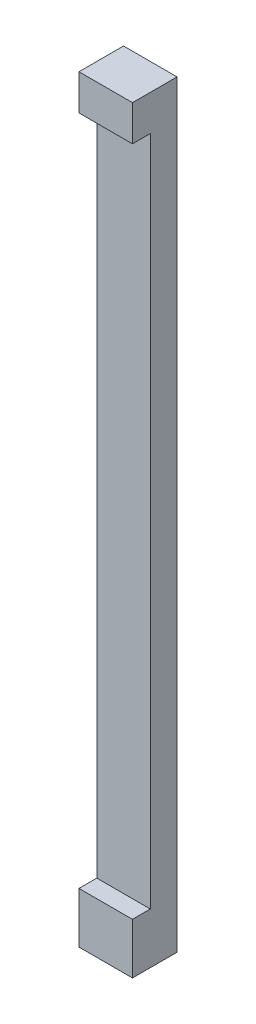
from build123d import *

# Parameters (mm, degrees)
ESQUISSE1_W                      = 60
ESQUISSE1_H                      = 850
BASE_EXTRUSION_DEPTH             = 50
ESQUISSE2_W                      = 20
ESQUISSE2_H                      = 753
ENL_V_MAT_EXTRU_1_DEPTH          = 854.580693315
TROU_TARAUD_M8X1_252_D           = 6.8
TROU_TARAUD_M8X1_252_DEPTH       = 52.249999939
TROU_TARAUD_M8X1_252_CBORE_D     = 8
TROU_TARAUD_M8X1_252_CBORE_DEPTH = 45.999999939
TROU_TARAUD_M8X1_252_TIP         = 2.042926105


with BuildPart() as part:
    # Esquisse1 → Base-Extrusion (new body)
    with BuildSketch(Plane.XY):
        with Locations((0, 425)):
            Rectangle(ESQUISSE1_W, ESQUISSE1_H)
    extrude(amount=BASE_EXTRUSION_DEPTH)

    # Esquisse2 → Enl_v. mat.-Extru.1 (cut, through all)
    with BuildSketch(Plane.ZY.offset(30)):
        with Locations((40, 433.5)):
            Rectangle(ESQUISSE2_W, ESQUISSE2_H)
    extrude(amount=-ENL_V_MAT_EXTRU_1_DEPTH, mode=Mode.SUBTRACT)

    # Trou taraud_ M8x1.252
    with Locations(Plane(origin=(710.721520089, -1601.599138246, -29.999999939), x_dir=(0, 1, 0), z_dir=(0, 0, -1))):
        with Locations((1626.599138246, -710.721517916)):
            CounterBoreHole(TROU_TARAUD_M8X1_252_D / 2, TROU_TARAUD_M8X1_252_CBORE_D / 2, TROU_TARAUD_M8X1_252_CBORE_DEPTH, depth=TROU_TARAUD_M8X1_252_DEPTH)
            with Locations((0, 0, -(TROU_TARAUD_M8X1_252_DEPTH + TROU_TARAUD_M8X1_252_TIP / 2))):  # 118° drill point
                Cone(0, TROU_TARAUD_M8X1_252_D / 2, TROU_TARAUD_M8X1_252_TIP, mode=Mode.SUBTRACT)


solid = part.part
